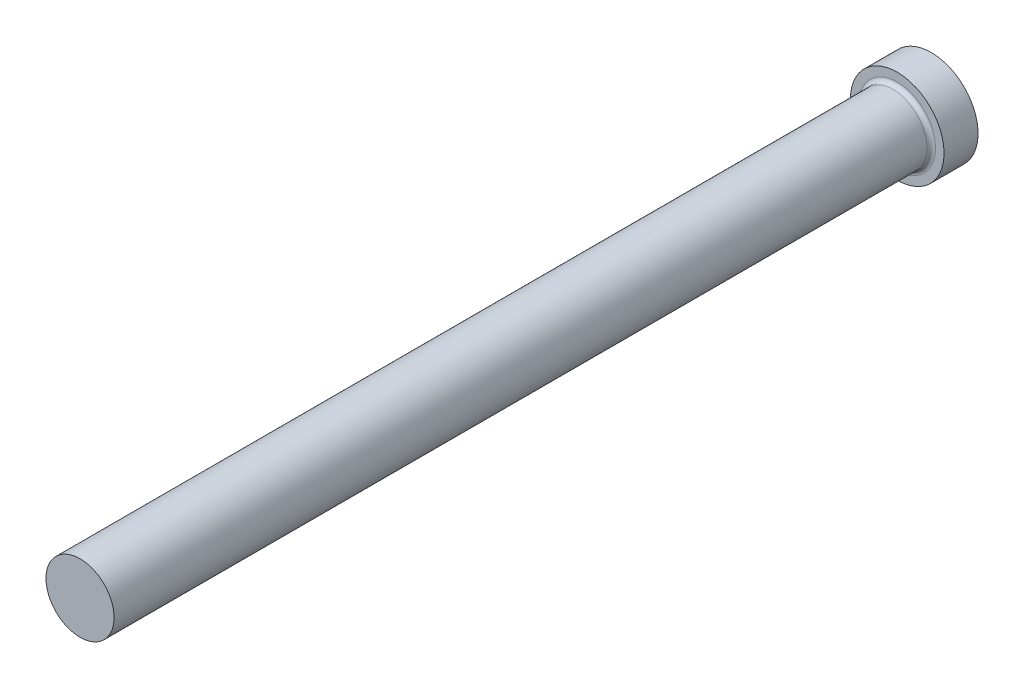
ISO-10303-21;
HEADER;
FILE_DESCRIPTION(('STEP AP214'),'2;1');
FILE_NAME('part.step','',(''),(''),'','','');
FILE_SCHEMA(('AUTOMOTIVE_DESIGN { 1 0 10303 214 1 1 1 1 }'));
ENDSEC;
DATA;
#1=APPLICATION_CONTEXT('core data for automotive mechanical design processes');
#2=APPLICATION_PROTOCOL_DEFINITION('international standard','automotive_design',2000,#1);
#3=PRODUCT_CONTEXT('',#1,'mechanical');
#4=PRODUCT('Part','Part','',(#3));
#5=PRODUCT_RELATED_PRODUCT_CATEGORY('part','',(#4));
#6=PRODUCT_DEFINITION_FORMATION('','',#4);
#7=PRODUCT_DEFINITION_CONTEXT('part definition',#1,'design');
#8=PRODUCT_DEFINITION('design','',#6,#7);
#9=PRODUCT_DEFINITION_SHAPE('','',#8);
#10=(LENGTH_UNIT() NAMED_UNIT(*) SI_UNIT(.MILLI.,.METRE.));
#11=(NAMED_UNIT(*) PLANE_ANGLE_UNIT() SI_UNIT($,.RADIAN.));
#12=(NAMED_UNIT(*) SI_UNIT($,.STERADIAN.) SOLID_ANGLE_UNIT());
#13=UNCERTAINTY_MEASURE_WITH_UNIT(LENGTH_MEASURE(1.E-05),#10,'distance_accuracy_value','');
#14=(GEOMETRIC_REPRESENTATION_CONTEXT(3) GLOBAL_UNCERTAINTY_ASSIGNED_CONTEXT((#13)) GLOBAL_UNIT_ASSIGNED_CONTEXT((#10,
#11,#12)) REPRESENTATION_CONTEXT('',''));
#15=CARTESIAN_POINT('',(0.,0.,0.));
#16=DIRECTION('',(0.,0.,1.));
#17=DIRECTION('',(1.,0.,0.));
#18=AXIS2_PLACEMENT_3D('',#15,#16,#17);
#19=CARTESIAN_POINT('',(5.5,0.,4.));
#20=DIRECTION('',(0.,0.,-1.));
#21=DIRECTION('',(-1.,0.,0.));
#22=AXIS2_PLACEMENT_3D('',#19,#20,#21);
#23=PLANE('',#22);
#24=CARTESIAN_POINT('',(0.,0.,4.));
#25=DIRECTION('',(0.,0.,-1.));
#26=DIRECTION('',(-1.,0.,0.));
#27=AXIS2_PLACEMENT_3D('',#24,#25,#26);
#28=CIRCLE('',#27,4.50000000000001);
#29=CARTESIAN_POINT('',(-4.50000000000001,0.,4.));
#30=VERTEX_POINT('',#29);
#31=EDGE_CURVE('E40',#30,#30,#28,.T.);
#32=ORIENTED_EDGE('',*,*,#31,.T.);
#33=EDGE_LOOP('',(#32));
#34=FACE_BOUND('',#33,.T.);
#35=CARTESIAN_POINT('',(0.,0.,4.));
#36=DIRECTION('',(0.,0.,-1.));
#37=DIRECTION('',(-1.,0.,0.));
#38=AXIS2_PLACEMENT_3D('',#35,#36,#37);
#39=CIRCLE('',#38,5.5);
#40=CARTESIAN_POINT('',(-5.5,0.,4.));
#41=VERTEX_POINT('',#40);
#42=EDGE_CURVE('E44',#41,#41,#39,.T.);
#43=ORIENTED_EDGE('',*,*,#42,.F.);
#44=EDGE_LOOP('',(#43));
#45=FACE_BOUND('',#44,.T.);
#46=ADVANCED_FACE('F33',(#34,#45),#23,.F.);
#47=CARTESIAN_POINT('',(0.,0.,-9.03322817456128));
#48=DIRECTION('',(0.,0.,-1.));
#49=DIRECTION('',(-1.,0.,0.));
#50=AXIS2_PLACEMENT_3D('',#47,#48,#49);
#51=CYLINDRICAL_SURFACE('',#50,5.5);
#52=CARTESIAN_POINT('',(0.,0.,0.));
#53=DIRECTION('',(0.,0.,-1.));
#54=DIRECTION('',(-1.,0.,0.));
#55=AXIS2_PLACEMENT_3D('',#52,#53,#54);
#56=CIRCLE('',#55,5.5);
#57=CARTESIAN_POINT('',(-5.5,0.,0.));
#58=VERTEX_POINT('',#57);
#59=EDGE_CURVE('E48',#58,#58,#56,.T.);
#60=ORIENTED_EDGE('',*,*,#59,.F.);
#61=EDGE_LOOP('',(#60));
#62=FACE_BOUND('',#61,.T.);
#63=ORIENTED_EDGE('',*,*,#42,.T.);
#64=EDGE_LOOP('',(#63));
#65=FACE_BOUND('',#64,.T.);
#66=ADVANCED_FACE('F68',(#62,#65),#51,.T.);
#67=CARTESIAN_POINT('',(0.,0.,0.));
#68=DIRECTION('',(0.,0.,1.));
#69=DIRECTION('',(1.,0.,0.));
#70=AXIS2_PLACEMENT_3D('',#67,#68,#69);
#71=PLANE('',#70);
#72=ORIENTED_EDGE('',*,*,#59,.T.);
#73=EDGE_LOOP('',(#72));
#74=FACE_BOUND('',#73,.T.);
#75=ADVANCED_FACE('F61',(#74),#71,.F.);
#76=CARTESIAN_POINT('',(0.,0.,100.));
#77=DIRECTION('',(0.,0.,-1.));
#78=DIRECTION('',(-1.,0.,0.));
#79=AXIS2_PLACEMENT_3D('',#76,#77,#78);
#80=PLANE('',#79);
#81=CARTESIAN_POINT('',(0.,0.,100.));
#82=DIRECTION('',(0.,0.,-1.));
#83=DIRECTION('',(-1.,0.,0.));
#84=AXIS2_PLACEMENT_3D('',#81,#82,#83);
#85=CIRCLE('',#84,4.00000000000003);
#86=CARTESIAN_POINT('',(-4.00000000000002,0.,100.));
#87=VERTEX_POINT('',#86);
#88=EDGE_CURVE('E53',#87,#87,#85,.T.);
#89=ORIENTED_EDGE('',*,*,#88,.F.);
#90=EDGE_LOOP('',(#89));
#91=FACE_BOUND('',#90,.T.);
#92=ADVANCED_FACE('F59',(#91),#80,.F.);
#93=CARTESIAN_POINT('',(0.,0.,-9.03322817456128));
#94=DIRECTION('',(0.,0.,-1.));
#95=DIRECTION('',(-1.,0.,0.));
#96=AXIS2_PLACEMENT_3D('',#93,#94,#95);
#97=CYLINDRICAL_SURFACE('',#96,4.00000000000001);
#98=CARTESIAN_POINT('',(0.,0.,4.5));
#99=DIRECTION('',(0.,0.,-1.));
#100=DIRECTION('',(-1.,0.,0.));
#101=AXIS2_PLACEMENT_3D('',#98,#99,#100);
#102=CIRCLE('',#101,4.00000000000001);
#103=CARTESIAN_POINT('',(-4.00000000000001,0.,4.5));
#104=VERTEX_POINT('',#103);
#105=EDGE_CURVE('E10',#104,#104,#102,.F.);
#106=ORIENTED_EDGE('',*,*,#105,.T.);
#107=EDGE_LOOP('',(#106));
#108=FACE_BOUND('',#107,.T.);
#109=ORIENTED_EDGE('',*,*,#88,.T.);
#110=EDGE_LOOP('',(#109));
#111=FACE_BOUND('',#110,.T.);
#112=ADVANCED_FACE('F57',(#108,#111),#97,.T.);
#113=CARTESIAN_POINT('',(0.,0.,4.5));
#114=DIRECTION('',(0.,0.,-1.));
#115=DIRECTION('',(-1.,0.,0.));
#116=AXIS2_PLACEMENT_3D('',#113,#114,#115);
#117=TOROIDAL_SURFACE('',#116,4.50000000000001,0.5);
#118=ORIENTED_EDGE('',*,*,#105,.F.);
#119=EDGE_LOOP('',(#118));
#120=FACE_BOUND('',#119,.T.);
#121=ORIENTED_EDGE('',*,*,#31,.F.);
#122=EDGE_LOOP('',(#121));
#123=FACE_BOUND('',#122,.T.);
#124=ADVANCED_FACE('F35',(#120,#123),#117,.F.);
#125=CLOSED_SHELL('',(#46,#66,#75,#92,#112,#124));
#126=MANIFOLD_SOLID_BREP('B2',#125);
#127=ADVANCED_BREP_SHAPE_REPRESENTATION('',(#18,#126),#14);
#128=SHAPE_DEFINITION_REPRESENTATION(#9,#127);
ENDSEC;
END-ISO-10303-21;
